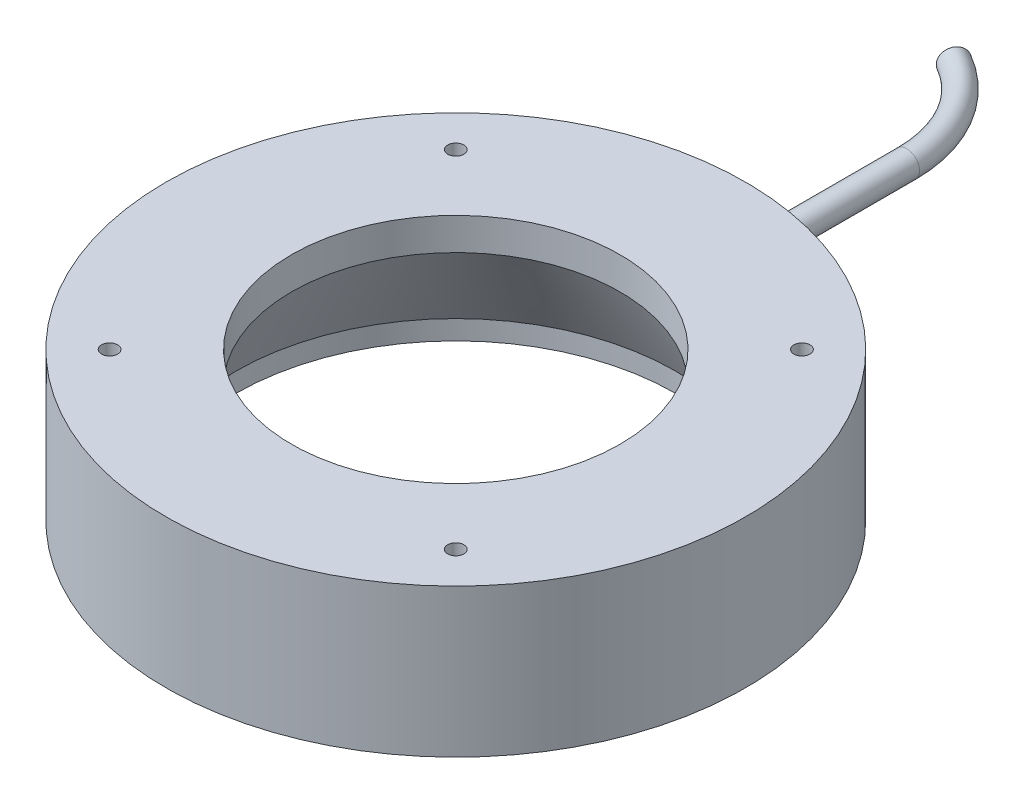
from build123d import *

# Parameters (mm, degrees)
M3_TAPPED_HOLE1_D     = 2.5
M3_TAPPED_HOLE1_DEPTH = 8.5
M3_TAPPED_HOLE1_TIP   = 0.751075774
EXTRUDE1_REACH        = 139.668
EXTRUDE1_END_RADIUS   = 45
EXTRUDE1_START        = -70
SKETCH4_R             = 2
SKETCH5_R             = 2


with BuildPart() as part:
    # Sketch1 → Revolve1 (revolve)
    with BuildSketch(Plane.XY):
        Polygon((-25.5, 0), (-45, 0), (-45, -23), (-34.160254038, -23), (-34.160254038, -20), (-25.5, -5), align=None)
    revolve(axis=Axis((0, 0, 0), (0, -1, 0)))

    # M3 Tapped Hole1
    with Locations(Plane(origin=(0, 0, 0), x_dir=(1, 0, 0), z_dir=(0, 1, 0))):
        with Locations((-26.870057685, 26.870057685), (-26.870057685, -26.870057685), (26.870057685, -26.870057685), (26.870057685, 26.870057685)):
            Hole(M3_TAPPED_HOLE1_D / 2, depth=M3_TAPPED_HOLE1_DEPTH)
            with Locations((0, 0, -(M3_TAPPED_HOLE1_DEPTH + M3_TAPPED_HOLE1_TIP / 2))):  # 118° drill point
                Cone(0, M3_TAPPED_HOLE1_D / 2, M3_TAPPED_HOLE1_TIP, mode=Mode.SUBTRACT)

    # Extrude1: up to this cylinder (the profile starts outside it)
    extrude1_end = Plane(origin=(0, -10, 0), z_dir=(0, 1, 0)) * Cylinder(EXTRUDE1_END_RADIUS, 370.336, mode=Mode.PRIVATE)
    # Sketch4 → Extrude1 (add, up to the surface)
    with BuildSketch(Plane.XY.offset(EXTRUDE1_START), mode=Mode.PRIVATE) as extrude1_sk1:
        with Locations(Location((0, -10, 0), (0, 0, 180))):
            Circle(SKETCH4_R)
    extrude1_tool1 = extrude(extrude1_sk1.sketch, amount=EXTRUDE1_REACH, mode=Mode.PRIVATE) - extrude1_end
    add(extrude1_tool1.solids().sort_by_distance((0, -10, -70))[0])

    # Sweep1: sweep along a path in Sketch6
    with BuildLine(Plane(origin=(0, -10, 0), x_dir=(1, 0, 0), z_dir=(0, 1, 0))) as sweep1_path:
        ThreePointArc((0, 70), (-2.679491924, 80), (-10, 87.320508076))
    # Sketch5 → Sweep1 (sweep)
    with BuildSketch(Plane(origin=(0, 0, -70), x_dir=(-1, 0, 0), z_dir=(0, 0, -1))):
        with Locations((0, -10)):
            Circle(SKETCH5_R)
    sweep(path=sweep1_path.line)


solid = part.part
